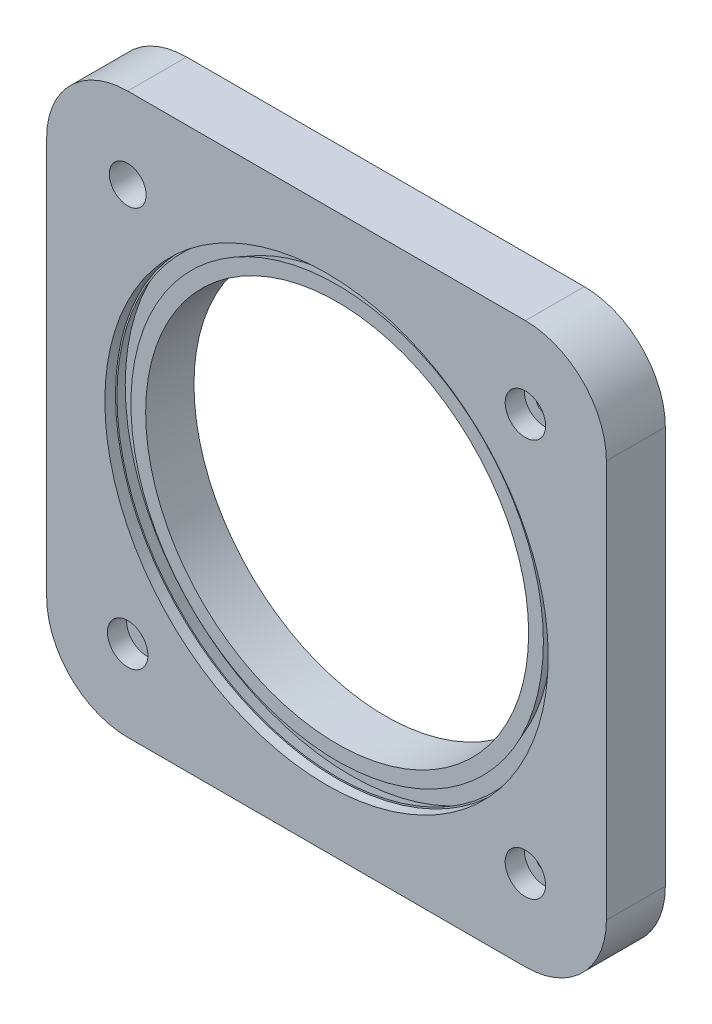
ISO-10303-21;
HEADER;
FILE_DESCRIPTION(('STEP AP214'),'2;1');
FILE_NAME('part.step','',(''),(''),'','','');
FILE_SCHEMA(('AUTOMOTIVE_DESIGN { 1 0 10303 214 1 1 1 1 }'));
ENDSEC;
DATA;
#1=APPLICATION_CONTEXT('core data for automotive mechanical design processes');
#2=APPLICATION_PROTOCOL_DEFINITION('international standard','automotive_design',2000,#1);
#3=PRODUCT_CONTEXT('',#1,'mechanical');
#4=PRODUCT('Part','Part','',(#3));
#5=PRODUCT_RELATED_PRODUCT_CATEGORY('part','',(#4));
#6=PRODUCT_DEFINITION_FORMATION('','',#4);
#7=PRODUCT_DEFINITION_CONTEXT('part definition',#1,'design');
#8=PRODUCT_DEFINITION('design','',#6,#7);
#9=PRODUCT_DEFINITION_SHAPE('','',#8);
#10=(LENGTH_UNIT() NAMED_UNIT(*) SI_UNIT(.MILLI.,.METRE.));
#11=(NAMED_UNIT(*) PLANE_ANGLE_UNIT() SI_UNIT($,.RADIAN.));
#12=(NAMED_UNIT(*) SI_UNIT($,.STERADIAN.) SOLID_ANGLE_UNIT());
#13=UNCERTAINTY_MEASURE_WITH_UNIT(LENGTH_MEASURE(1.E-05),#10,'distance_accuracy_value','');
#14=(GEOMETRIC_REPRESENTATION_CONTEXT(3) GLOBAL_UNCERTAINTY_ASSIGNED_CONTEXT((#13)) GLOBAL_UNIT_ASSIGNED_CONTEXT((#10,
#11,#12)) REPRESENTATION_CONTEXT('',''));
#15=CARTESIAN_POINT('',(0.,0.,0.));
#16=DIRECTION('',(0.,0.,1.));
#17=DIRECTION('',(1.,0.,0.));
#18=AXIS2_PLACEMENT_3D('',#15,#16,#17);
#19=CARTESIAN_POINT('',(-85.725,85.725,0.));
#20=DIRECTION('',(0.,0.,-1.));
#21=DIRECTION('',(-1.,0.,0.));
#22=AXIS2_PLACEMENT_3D('',#19,#20,#21);
#23=PLANE('',#22);
#24=CARTESIAN_POINT('',(0.,0.,0.));
#25=DIRECTION('',(0.,0.,1.));
#26=DIRECTION('',(1.,0.,0.));
#27=AXIS2_PLACEMENT_3D('',#24,#25,#26);
#28=CIRCLE('',#27,82.55);
#29=CARTESIAN_POINT('',(-82.55,0.,0.));
#30=VERTEX_POINT('',#29);
#31=EDGE_CURVE('E116',#30,#30,#28,.T.);
#32=ORIENTED_EDGE('',*,*,#31,.T.);
#33=EDGE_LOOP('',(#32));
#34=FACE_BOUND('',#33,.T.);
#35=CARTESIAN_POINT('',(0.,0.,0.));
#36=DIRECTION('',(0.,0.,-1.));
#37=DIRECTION('',(-1.,0.,0.));
#38=AXIS2_PLACEMENT_3D('',#35,#36,#37);
#39=CIRCLE('',#38,86.6267);
#40=CARTESIAN_POINT('',(-86.6267,0.,0.));
#41=VERTEX_POINT('',#40);
#42=EDGE_CURVE('E396',#41,#41,#39,.T.);
#43=ORIENTED_EDGE('',*,*,#42,.T.);
#44=EDGE_LOOP('',(#43));
#45=FACE_BOUND('',#44,.T.);
#46=ADVANCED_FACE('F31',(#34,#45),#23,.T.);
#47=CARTESIAN_POINT('',(-85.725,85.725,25.4));
#48=DIRECTION('',(0.,0.,-1.));
#49=DIRECTION('',(-1.,0.,0.));
#50=AXIS2_PLACEMENT_3D('',#47,#48,#49);
#51=PLANE('',#50);
#52=CARTESIAN_POINT('',(85.725,85.725,25.4));
#53=DIRECTION('',(0.,0.,-1.));
#54=DIRECTION('',(-1.,0.,0.));
#55=AXIS2_PLACEMENT_3D('',#52,#53,#54);
#56=CIRCLE('',#55,8.7122);
#57=CARTESIAN_POINT('',(77.0128,85.725,25.4));
#58=VERTEX_POINT('',#57);
#59=EDGE_CURVE('E193',#58,#58,#56,.T.);
#60=ORIENTED_EDGE('',*,*,#59,.T.);
#61=EDGE_LOOP('',(#60));
#62=FACE_BOUND('',#61,.T.);
#63=CARTESIAN_POINT('',(85.725,-85.725,25.4));
#64=DIRECTION('',(0.,0.,1.));
#65=DIRECTION('',(1.,0.,0.));
#66=AXIS2_PLACEMENT_3D('',#63,#64,#65);
#67=CIRCLE('',#66,8.7122);
#68=CARTESIAN_POINT('',(94.4372,-85.725,25.4));
#69=VERTEX_POINT('',#68);
#70=EDGE_CURVE('E186',#69,#69,#67,.T.);
#71=ORIENTED_EDGE('',*,*,#70,.F.);
#72=EDGE_LOOP('',(#71));
#73=FACE_BOUND('',#72,.T.);
#74=CARTESIAN_POINT('',(0.,0.,25.4));
#75=DIRECTION('',(0.,0.,1.));
#76=DIRECTION('',(1.,0.,0.));
#77=AXIS2_PLACEMENT_3D('',#74,#75,#76);
#78=CIRCLE('',#77,95.5675);
#79=CARTESIAN_POINT('',(95.5675,0.,25.4));
#80=VERTEX_POINT('',#79);
#81=EDGE_CURVE('E168',#80,#80,#78,.T.);
#82=ORIENTED_EDGE('',*,*,#81,.F.);
#83=EDGE_LOOP('',(#82));
#84=FACE_BOUND('',#83,.T.);
#85=CARTESIAN_POINT('',(-85.725,85.725,25.4));
#86=DIRECTION('',(0.,0.,-1.));
#87=DIRECTION('',(-1.,0.,0.));
#88=AXIS2_PLACEMENT_3D('',#85,#86,#87);
#89=CIRCLE('',#88,34.925);
#90=CARTESIAN_POINT('',(-120.65,85.7249999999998,25.4));
#91=VERTEX_POINT('',#90);
#92=CARTESIAN_POINT('',(-85.7249999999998,120.65,25.4));
#93=VERTEX_POINT('',#92);
#94=EDGE_CURVE('E99',#91,#93,#89,.T.);
#95=ORIENTED_EDGE('',*,*,#94,.F.);
#96=DIRECTION('',(0.,-1.,0.));
#97=VECTOR('',#96,1.);
#98=CARTESIAN_POINT('',(-120.65,85.7249999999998,25.4));
#99=LINE('',#98,#97);
#100=CARTESIAN_POINT('',(-120.65,-85.7249999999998,25.4));
#101=VERTEX_POINT('',#100);
#102=EDGE_CURVE('E105',#91,#101,#99,.T.);
#103=ORIENTED_EDGE('',*,*,#102,.T.);
#104=CARTESIAN_POINT('',(-85.725,-85.725,25.4));
#105=DIRECTION('',(0.,0.,-1.));
#106=DIRECTION('',(-1.,0.,0.));
#107=AXIS2_PLACEMENT_3D('',#104,#105,#106);
#108=CIRCLE('',#107,34.925);
#109=CARTESIAN_POINT('',(-85.7249999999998,-120.65,25.4));
#110=VERTEX_POINT('',#109);
#111=EDGE_CURVE('E151',#110,#101,#108,.T.);
#112=ORIENTED_EDGE('',*,*,#111,.F.);
#113=DIRECTION('',(-1.,0.,0.));
#114=VECTOR('',#113,1.);
#115=CARTESIAN_POINT('',(85.7249999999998,-120.65,25.4));
#116=LINE('',#115,#114);
#117=CARTESIAN_POINT('',(85.7249999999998,-120.65,25.4));
#118=VERTEX_POINT('',#117);
#119=EDGE_CURVE('E148',#118,#110,#116,.T.);
#120=ORIENTED_EDGE('',*,*,#119,.F.);
#121=CARTESIAN_POINT('',(85.725,-85.725,25.4));
#122=DIRECTION('',(0.,0.,1.));
#123=DIRECTION('',(1.,0.,0.));
#124=AXIS2_PLACEMENT_3D('',#121,#122,#123);
#125=CIRCLE('',#124,34.925);
#126=CARTESIAN_POINT('',(120.65,-85.7249999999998,25.4));
#127=VERTEX_POINT('',#126);
#128=EDGE_CURVE('E145',#118,#127,#125,.T.);
#129=ORIENTED_EDGE('',*,*,#128,.T.);
#130=DIRECTION('',(0.,-1.,0.));
#131=VECTOR('',#130,1.);
#132=CARTESIAN_POINT('',(120.65,85.7249999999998,25.4));
#133=LINE('',#132,#131);
#134=CARTESIAN_POINT('',(120.65,85.7249999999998,25.4));
#135=VERTEX_POINT('',#134);
#136=EDGE_CURVE('E142',#135,#127,#133,.T.);
#137=ORIENTED_EDGE('',*,*,#136,.F.);
#138=CARTESIAN_POINT('',(85.725,85.725,25.4));
#139=DIRECTION('',(0.,0.,-1.));
#140=DIRECTION('',(-1.,0.,0.));
#141=AXIS2_PLACEMENT_3D('',#138,#139,#140);
#142=CIRCLE('',#141,34.925);
#143=CARTESIAN_POINT('',(85.7249999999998,120.65,25.4));
#144=VERTEX_POINT('',#143);
#145=EDGE_CURVE('E139',#144,#135,#142,.T.);
#146=ORIENTED_EDGE('',*,*,#145,.F.);
#147=DIRECTION('',(-1.,0.,0.));
#148=VECTOR('',#147,1.);
#149=CARTESIAN_POINT('',(85.7249999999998,120.65,25.4));
#150=LINE('',#149,#148);
#151=EDGE_CURVE('E137',#144,#93,#150,.T.);
#152=ORIENTED_EDGE('',*,*,#151,.T.);
#153=EDGE_LOOP('',(#95,#103,#112,#120,#129,#137,#146,#152));
#154=FACE_BOUND('',#153,.T.);
#155=CARTESIAN_POINT('',(-85.725,85.725,25.4));
#156=DIRECTION('',(0.,0.,1.));
#157=DIRECTION('',(1.,0.,0.));
#158=AXIS2_PLACEMENT_3D('',#155,#156,#157);
#159=CIRCLE('',#158,7.9375);
#160=CARTESIAN_POINT('',(-93.6625,85.725,25.4));
#161=VERTEX_POINT('',#160);
#162=EDGE_CURVE('E238',#161,#161,#159,.T.);
#163=ORIENTED_EDGE('',*,*,#162,.F.);
#164=EDGE_LOOP('',(#163));
#165=FACE_BOUND('',#164,.T.);
#166=CARTESIAN_POINT('',(-85.725,-85.725,25.4));
#167=DIRECTION('',(0.,0.,-1.));
#168=DIRECTION('',(-1.,0.,0.));
#169=AXIS2_PLACEMENT_3D('',#166,#167,#168);
#170=CIRCLE('',#169,8.7122);
#171=CARTESIAN_POINT('',(-94.4372,-85.725,25.4));
#172=VERTEX_POINT('',#171);
#173=EDGE_CURVE('E383',#172,#172,#170,.T.);
#174=ORIENTED_EDGE('',*,*,#173,.T.);
#175=EDGE_LOOP('',(#174));
#176=FACE_BOUND('',#175,.T.);
#177=ADVANCED_FACE('F290',(#62,#73,#84,#154,#165,#176),#51,.F.);
#178=CARTESIAN_POINT('',(85.4964,-85.4964,25.4));
#179=DIRECTION('',(0.,0.,-1.));
#180=DIRECTION('',(-1.,0.,0.));
#181=AXIS2_PLACEMENT_3D('',#178,#179,#180);
#182=CYLINDRICAL_SURFACE('',#181,3.36549999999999);
#183=CARTESIAN_POINT('',(85.4964,-85.4964,2.54));
#184=DIRECTION('',(0.,0.,1.));
#185=DIRECTION('',(1.,0.,0.));
#186=AXIS2_PLACEMENT_3D('',#183,#184,#185);
#187=CIRCLE('',#186,3.36549999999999);
#188=CARTESIAN_POINT('',(82.1309,-85.4964,2.54));
#189=VERTEX_POINT('',#188);
#190=EDGE_CURVE('E170',#189,#189,#187,.F.);
#191=CARTESIAN_POINT('',(85.4964,-85.4964,17.145));
#192=DIRECTION('',(0.,0.,1.));
#193=DIRECTION('',(1.,0.,0.));
#194=AXIS2_PLACEMENT_3D('',#191,#192,#193);
#195=CIRCLE('',#194,3.36549999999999);
#196=CARTESIAN_POINT('',(82.1309,-85.4964,17.145));
#197=VERTEX_POINT('',#196);
#198=EDGE_CURVE('E180',#197,#197,#195,.F.);
#199=CARTESIAN_POINT('',(82.1309,-85.4964,2.54));
#200=CARTESIAN_POINT('',(82.1309,-85.4964,2.69213541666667));
#201=CARTESIAN_POINT('',(82.1309,-85.4964,2.84427083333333));
#202=CARTESIAN_POINT('',(82.1309,-85.4964,3.14854166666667));
#203=CARTESIAN_POINT('',(82.1309,-85.4964,3.30067708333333));
#204=CARTESIAN_POINT('',(82.1309,-85.4964,3.60494791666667));
#205=CARTESIAN_POINT('',(82.1309,-85.4964,3.75708333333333));
#206=CARTESIAN_POINT('',(82.1309,-85.4964,4.06135416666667));
#207=CARTESIAN_POINT('',(82.1309,-85.4964,4.21348958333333));
#208=CARTESIAN_POINT('',(82.1309,-85.4964,4.51776041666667));
#209=CARTESIAN_POINT('',(82.1309,-85.4964,4.66989583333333));
#210=CARTESIAN_POINT('',(82.1309,-85.4964,4.97416666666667));
#211=CARTESIAN_POINT('',(82.1309,-85.4964,5.12630208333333));
#212=CARTESIAN_POINT('',(82.1309,-85.4964,5.43057291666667));
#213=CARTESIAN_POINT('',(82.1309,-85.4964,5.58270833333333));
#214=CARTESIAN_POINT('',(82.1309,-85.4964,5.88697916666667));
#215=CARTESIAN_POINT('',(82.1309,-85.4964,6.03911458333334));
#216=CARTESIAN_POINT('',(82.1309,-85.4964,6.34338541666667));
#217=CARTESIAN_POINT('',(82.1309,-85.4964,6.49552083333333));
#218=CARTESIAN_POINT('',(82.1309,-85.4964,6.79979166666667));
#219=CARTESIAN_POINT('',(82.1309,-85.4964,6.95192708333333));
#220=CARTESIAN_POINT('',(82.1309,-85.4964,7.25619791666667));
#221=CARTESIAN_POINT('',(82.1309,-85.4964,7.40833333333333));
#222=CARTESIAN_POINT('',(82.1309,-85.4964,7.71260416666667));
#223=CARTESIAN_POINT('',(82.1309,-85.4964,7.86473958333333));
#224=CARTESIAN_POINT('',(82.1309,-85.4964,8.16901041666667));
#225=CARTESIAN_POINT('',(82.1309,-85.4964,8.32114583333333));
#226=CARTESIAN_POINT('',(82.1309,-85.4964,8.62541666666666));
#227=CARTESIAN_POINT('',(82.1309,-85.4964,8.77755208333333));
#228=CARTESIAN_POINT('',(82.1309,-85.4964,9.08182291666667));
#229=CARTESIAN_POINT('',(82.1309,-85.4964,9.23395833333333));
#230=CARTESIAN_POINT('',(82.1309,-85.4964,9.53822916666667));
#231=CARTESIAN_POINT('',(82.1309,-85.4964,9.69036458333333));
#232=CARTESIAN_POINT('',(82.1309,-85.4964,9.99463541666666));
#233=CARTESIAN_POINT('',(82.1309,-85.4964,10.1467708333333));
#234=CARTESIAN_POINT('',(82.1309,-85.4964,10.4510416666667));
#235=CARTESIAN_POINT('',(82.1309,-85.4964,10.6031770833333));
#236=CARTESIAN_POINT('',(82.1309,-85.4964,10.9074479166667));
#237=CARTESIAN_POINT('',(82.1309,-85.4964,11.0595833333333));
#238=CARTESIAN_POINT('',(82.1309,-85.4964,11.3638541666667));
#239=CARTESIAN_POINT('',(82.1309,-85.4964,11.5159895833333));
#240=CARTESIAN_POINT('',(82.1309,-85.4964,11.8202604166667));
#241=CARTESIAN_POINT('',(82.1309,-85.4964,11.9723958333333));
#242=CARTESIAN_POINT('',(82.1309,-85.4964,12.2766666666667));
#243=CARTESIAN_POINT('',(82.1309,-85.4964,12.4288020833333));
#244=CARTESIAN_POINT('',(82.1309,-85.4964,12.7330729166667));
#245=CARTESIAN_POINT('',(82.1309,-85.4964,12.8852083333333));
#246=CARTESIAN_POINT('',(82.1309,-85.4964,13.1894791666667));
#247=CARTESIAN_POINT('',(82.1309,-85.4964,13.3416145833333));
#248=CARTESIAN_POINT('',(82.1309,-85.4964,13.6458854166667));
#249=CARTESIAN_POINT('',(82.1309,-85.4964,13.7980208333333));
#250=CARTESIAN_POINT('',(82.1309,-85.4964,14.1022916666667));
#251=CARTESIAN_POINT('',(82.1309,-85.4964,14.2544270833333));
#252=CARTESIAN_POINT('',(82.1309,-85.4964,14.5586979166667));
#253=CARTESIAN_POINT('',(82.1309,-85.4964,14.7108333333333));
#254=CARTESIAN_POINT('',(82.1309,-85.4964,15.0151041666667));
#255=CARTESIAN_POINT('',(82.1309,-85.4964,15.1672395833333));
#256=CARTESIAN_POINT('',(82.1309,-85.4964,15.4715104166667));
#257=CARTESIAN_POINT('',(82.1309,-85.4964,15.6236458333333));
#258=CARTESIAN_POINT('',(82.1309,-85.4964,15.9279166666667));
#259=CARTESIAN_POINT('',(82.1309,-85.4964,16.0800520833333));
#260=CARTESIAN_POINT('',(82.1309,-85.4964,16.3843229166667));
#261=CARTESIAN_POINT('',(82.1309,-85.4964,16.5364583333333));
#262=CARTESIAN_POINT('',(82.1309,-85.4964,16.8407291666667));
#263=CARTESIAN_POINT('',(82.1309,-85.4964,16.9928645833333));
#264=CARTESIAN_POINT('',(82.1309,-85.4964,17.145));
#265=B_SPLINE_CURVE_WITH_KNOTS('',3,(#199,#200,#201,#202,#203,#204,#205,#206,#207,#208,#209,
#210,#211,#212,#213,#214,#215,#216,#217,#218,#219,#220,#221,#222,#223,#224,#225,#226,#227,#228,
#229,#230,#231,#232,#233,#234,#235,#236,#237,#238,#239,#240,#241,#242,#243,#244,#245,#246,#247,
#248,#249,#250,#251,#252,#253,#254,#255,#256,#257,#258,#259,#260,#261,#262,#263,#264),
.UNSPECIFIED.,.F.,.F.,(4,2,2,2,2,2,2,2,2,2,2,2,2,2,2,2,2,2,2,2,2,2,2,2,2,2,2,2,2,2,2,2,4),(0.,
0.456406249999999,0.912812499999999,1.36921875,1.825625,2.28203125,2.7384375,3.19484375,3.65125,
4.10765625,4.5640625,5.02046875,5.476875,5.93328125,6.3896875,6.84609375,7.3025,7.75890625,
8.2153125,8.67171875,9.128125,9.58453125,10.0409375,10.49734375,10.95375,11.41015625,11.8665625,
12.32296875,12.779375,13.23578125,13.6921875,14.14859375,14.605),.UNSPECIFIED.);
#266=EDGE_CURVE('BSEAM295',#189,#197,#265,.T.);
#267=ORIENTED_EDGE('',*,*,#190,.T.);
#268=ORIENTED_EDGE('',*,*,#198,.F.);
#269=ORIENTED_EDGE('',*,*,#266,.T.);
#270=ORIENTED_EDGE('',*,*,#266,.F.);
#271=EDGE_LOOP('',(#267,#269,#268,#270));
#272=FACE_BOUND('',#271,.T.);
#273=ADVANCED_FACE('F295',(#272),#182,.F.);
#274=CARTESIAN_POINT('',(85.4964,85.4964,25.4));
#275=DIRECTION('',(0.,0.,-1.));
#276=DIRECTION('',(-1.,0.,0.));
#277=AXIS2_PLACEMENT_3D('',#274,#275,#276);
#278=CYLINDRICAL_SURFACE('',#277,3.36549999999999);
#279=CARTESIAN_POINT('',(85.4964,85.4964,17.145));
#280=DIRECTION('',(0.,0.,-1.));
#281=DIRECTION('',(-1.,0.,0.));
#282=AXIS2_PLACEMENT_3D('',#279,#280,#281);
#283=CIRCLE('',#282,3.36549999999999);
#284=CARTESIAN_POINT('',(82.1309,85.4964,17.145));
#285=VERTEX_POINT('',#284);
#286=EDGE_CURVE('E184',#285,#285,#283,.T.);
#287=CARTESIAN_POINT('',(85.4964,85.4964,2.54));
#288=DIRECTION('',(0.,0.,-1.));
#289=DIRECTION('',(-1.,0.,0.));
#290=AXIS2_PLACEMENT_3D('',#287,#288,#289);
#291=CIRCLE('',#290,3.36549999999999);
#292=CARTESIAN_POINT('',(82.1309,85.4964,2.54));
#293=VERTEX_POINT('',#292);
#294=EDGE_CURVE('E175',#293,#293,#291,.T.);
#295=CARTESIAN_POINT('',(82.1309,85.4964,17.145));
#296=CARTESIAN_POINT('',(82.1309,85.4964,16.9928645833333));
#297=CARTESIAN_POINT('',(82.1309,85.4964,16.8407291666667));
#298=CARTESIAN_POINT('',(82.1309,85.4964,16.5364583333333));
#299=CARTESIAN_POINT('',(82.1309,85.4964,16.3843229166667));
#300=CARTESIAN_POINT('',(82.1309,85.4964,16.0800520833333));
#301=CARTESIAN_POINT('',(82.1309,85.4964,15.9279166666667));
#302=CARTESIAN_POINT('',(82.1309,85.4964,15.6236458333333));
#303=CARTESIAN_POINT('',(82.1309,85.4964,15.4715104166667));
#304=CARTESIAN_POINT('',(82.1309,85.4964,15.1672395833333));
#305=CARTESIAN_POINT('',(82.1309,85.4964,15.0151041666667));
#306=CARTESIAN_POINT('',(82.1309,85.4964,14.7108333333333));
#307=CARTESIAN_POINT('',(82.1309,85.4964,14.5586979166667));
#308=CARTESIAN_POINT('',(82.1309,85.4964,14.2544270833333));
#309=CARTESIAN_POINT('',(82.1309,85.4964,14.1022916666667));
#310=CARTESIAN_POINT('',(82.1309,85.4964,13.7980208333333));
#311=CARTESIAN_POINT('',(82.1309,85.4964,13.6458854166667));
#312=CARTESIAN_POINT('',(82.1309,85.4964,13.3416145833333));
#313=CARTESIAN_POINT('',(82.1309,85.4964,13.1894791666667));
#314=CARTESIAN_POINT('',(82.1309,85.4964,12.8852083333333));
#315=CARTESIAN_POINT('',(82.1309,85.4964,12.7330729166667));
#316=CARTESIAN_POINT('',(82.1309,85.4964,12.4288020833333));
#317=CARTESIAN_POINT('',(82.1309,85.4964,12.2766666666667));
#318=CARTESIAN_POINT('',(82.1309,85.4964,11.9723958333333));
#319=CARTESIAN_POINT('',(82.1309,85.4964,11.8202604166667));
#320=CARTESIAN_POINT('',(82.1309,85.4964,11.5159895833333));
#321=CARTESIAN_POINT('',(82.1309,85.4964,11.3638541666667));
#322=CARTESIAN_POINT('',(82.1309,85.4964,11.0595833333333));
#323=CARTESIAN_POINT('',(82.1309,85.4964,10.9074479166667));
#324=CARTESIAN_POINT('',(82.1309,85.4964,10.6031770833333));
#325=CARTESIAN_POINT('',(82.1309,85.4964,10.4510416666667));
#326=CARTESIAN_POINT('',(82.1309,85.4964,10.1467708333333));
#327=CARTESIAN_POINT('',(82.1309,85.4964,9.99463541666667));
#328=CARTESIAN_POINT('',(82.1309,85.4964,9.69036458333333));
#329=CARTESIAN_POINT('',(82.1309,85.4964,9.53822916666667));
#330=CARTESIAN_POINT('',(82.1309,85.4964,9.23395833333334));
#331=CARTESIAN_POINT('',(82.1309,85.4964,9.08182291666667));
#332=CARTESIAN_POINT('',(82.1309,85.4964,8.77755208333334));
#333=CARTESIAN_POINT('',(82.1309,85.4964,8.62541666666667));
#334=CARTESIAN_POINT('',(82.1309,85.4964,8.32114583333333));
#335=CARTESIAN_POINT('',(82.1309,85.4964,8.16901041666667));
#336=CARTESIAN_POINT('',(82.1309,85.4964,7.86473958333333));
#337=CARTESIAN_POINT('',(82.1309,85.4964,7.71260416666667));
#338=CARTESIAN_POINT('',(82.1309,85.4964,7.40833333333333));
#339=CARTESIAN_POINT('',(82.1309,85.4964,7.25619791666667));
#340=CARTESIAN_POINT('',(82.1309,85.4964,6.95192708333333));
#341=CARTESIAN_POINT('',(82.1309,85.4964,6.79979166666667));
#342=CARTESIAN_POINT('',(82.1309,85.4964,6.49552083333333));
#343=CARTESIAN_POINT('',(82.1309,85.4964,6.34338541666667));
#344=CARTESIAN_POINT('',(82.1309,85.4964,6.03911458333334));
#345=CARTESIAN_POINT('',(82.1309,85.4964,5.88697916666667));
#346=CARTESIAN_POINT('',(82.1309,85.4964,5.58270833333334));
#347=CARTESIAN_POINT('',(82.1309,85.4964,5.43057291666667));
#348=CARTESIAN_POINT('',(82.1309,85.4964,5.12630208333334));
#349=CARTESIAN_POINT('',(82.1309,85.4964,4.97416666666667));
#350=CARTESIAN_POINT('',(82.1309,85.4964,4.66989583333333));
#351=CARTESIAN_POINT('',(82.1309,85.4964,4.51776041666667));
#352=CARTESIAN_POINT('',(82.1309,85.4964,4.21348958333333));
#353=CARTESIAN_POINT('',(82.1309,85.4964,4.06135416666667));
#354=CARTESIAN_POINT('',(82.1309,85.4964,3.75708333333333));
#355=CARTESIAN_POINT('',(82.1309,85.4964,3.60494791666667));
#356=CARTESIAN_POINT('',(82.1309,85.4964,3.30067708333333));
#357=CARTESIAN_POINT('',(82.1309,85.4964,3.14854166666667));
#358=CARTESIAN_POINT('',(82.1309,85.4964,2.84427083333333));
#359=CARTESIAN_POINT('',(82.1309,85.4964,2.69213541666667));
#360=CARTESIAN_POINT('',(82.1309,85.4964,2.54));
#361=B_SPLINE_CURVE_WITH_KNOTS('',3,(#295,#296,#297,#298,#299,#300,#301,#302,#303,#304,#305,
#306,#307,#308,#309,#310,#311,#312,#313,#314,#315,#316,#317,#318,#319,#320,#321,#322,#323,#324,
#325,#326,#327,#328,#329,#330,#331,#332,#333,#334,#335,#336,#337,#338,#339,#340,#341,#342,#343,
#344,#345,#346,#347,#348,#349,#350,#351,#352,#353,#354,#355,#356,#357,#358,#359,#360),
.UNSPECIFIED.,.F.,.F.,(4,2,2,2,2,2,2,2,2,2,2,2,2,2,2,2,2,2,2,2,2,2,2,2,2,2,2,2,2,2,2,2,4),(0.,
0.456406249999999,0.912812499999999,1.36921875,1.825625,2.28203125,2.7384375,3.19484375,3.65125,
4.10765625,4.5640625,5.02046875,5.476875,5.93328125,6.3896875,6.84609375,7.3025,7.75890625,
8.2153125,8.67171875,9.128125,9.58453125,10.0409375,10.49734375,10.95375,11.41015625,11.8665625,
12.32296875,12.779375,13.23578125,13.6921875,14.14859375,14.605),.UNSPECIFIED.);
#362=EDGE_CURVE('BSEAM299',#285,#293,#361,.T.);
#363=ORIENTED_EDGE('',*,*,#286,.F.);
#364=ORIENTED_EDGE('',*,*,#294,.T.);
#365=ORIENTED_EDGE('',*,*,#362,.T.);
#366=ORIENTED_EDGE('',*,*,#362,.F.);
#367=EDGE_LOOP('',(#363,#365,#364,#366));
#368=FACE_BOUND('',#367,.T.);
#369=ADVANCED_FACE('F299',(#368),#278,.F.);
#370=CARTESIAN_POINT('',(0.,0.,0.));
#371=DIRECTION('',(0.,0.,-1.));
#372=DIRECTION('',(-1.,0.,0.));
#373=AXIS2_PLACEMENT_3D('',#370,#371,#372);
#374=CIRCLE('',#373,95.5675);
#375=CARTESIAN_POINT('',(-95.5675,0.,0.));
#376=VERTEX_POINT('',#375);
#377=EDGE_CURVE('E312',#376,#376,#374,.T.);
#378=ORIENTED_EDGE('',*,*,#377,.F.);
#379=EDGE_LOOP('',(#378));
#380=FACE_BOUND('',#379,.T.);
#381=CARTESIAN_POINT('',(85.725,85.725,0.));
#382=DIRECTION('',(0.,0.,-1.));
#383=DIRECTION('',(-1.,0.,0.));
#384=AXIS2_PLACEMENT_3D('',#381,#382,#383);
#385=CIRCLE('',#384,6.477);
#386=CARTESIAN_POINT('',(79.248,85.725,0.));
#387=VERTEX_POINT('',#386);
#388=EDGE_CURVE('E182',#387,#387,#385,.T.);
#389=ORIENTED_EDGE('',*,*,#388,.F.);
#390=EDGE_LOOP('',(#389));
#391=FACE_BOUND('',#390,.T.);
#392=CARTESIAN_POINT('',(-85.725,85.725,0.));
#393=DIRECTION('',(0.,0.,1.));
#394=DIRECTION('',(1.,0.,0.));
#395=AXIS2_PLACEMENT_3D('',#392,#393,#394);
#396=CIRCLE('',#395,7.9375);
#397=CARTESIAN_POINT('',(-93.6625,85.725,0.));
#398=VERTEX_POINT('',#397);
#399=EDGE_CURVE('E235',#398,#398,#396,.T.);
#400=ORIENTED_EDGE('',*,*,#399,.T.);
#401=EDGE_LOOP('',(#400));
#402=FACE_BOUND('',#401,.T.);
#403=CARTESIAN_POINT('',(-85.725,85.725,0.));
#404=DIRECTION('',(0.,0.,-1.));
#405=DIRECTION('',(-1.,0.,0.));
#406=AXIS2_PLACEMENT_3D('',#403,#404,#405);
#407=CIRCLE('',#406,34.925);
#408=CARTESIAN_POINT('',(-120.65,85.7249999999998,0.));
#409=VERTEX_POINT('',#408);
#410=CARTESIAN_POINT('',(-85.7249999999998,120.65,0.));
#411=VERTEX_POINT('',#410);
#412=EDGE_CURVE('E97',#409,#411,#407,.T.);
#413=ORIENTED_EDGE('',*,*,#412,.T.);
#414=DIRECTION('',(-1.,0.,0.));
#415=VECTOR('',#414,1.);
#416=CARTESIAN_POINT('',(85.7249999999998,120.65,0.));
#417=LINE('',#416,#415);
#418=CARTESIAN_POINT('',(85.7249999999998,120.65,0.));
#419=VERTEX_POINT('',#418);
#420=EDGE_CURVE('E112',#419,#411,#417,.T.);
#421=ORIENTED_EDGE('',*,*,#420,.F.);
#422=CARTESIAN_POINT('',(85.725,85.725,0.));
#423=DIRECTION('',(0.,0.,-1.));
#424=DIRECTION('',(-1.,0.,0.));
#425=AXIS2_PLACEMENT_3D('',#422,#423,#424);
#426=CIRCLE('',#425,34.925);
#427=CARTESIAN_POINT('',(120.65,85.7249999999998,0.));
#428=VERTEX_POINT('',#427);
#429=EDGE_CURVE('E119',#419,#428,#426,.T.);
#430=ORIENTED_EDGE('',*,*,#429,.T.);
#431=DIRECTION('',(0.,-1.,0.));
#432=VECTOR('',#431,1.);
#433=CARTESIAN_POINT('',(120.65,85.7249999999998,0.));
#434=LINE('',#433,#432);
#435=CARTESIAN_POINT('',(120.65,-85.7249999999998,0.));
#436=VERTEX_POINT('',#435);
#437=EDGE_CURVE('E121',#428,#436,#434,.T.);
#438=ORIENTED_EDGE('',*,*,#437,.T.);
#439=CARTESIAN_POINT('',(85.725,-85.725,0.));
#440=DIRECTION('',(0.,0.,1.));
#441=DIRECTION('',(1.,0.,0.));
#442=AXIS2_PLACEMENT_3D('',#439,#440,#441);
#443=CIRCLE('',#442,34.925);
#444=CARTESIAN_POINT('',(85.7249999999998,-120.65,0.));
#445=VERTEX_POINT('',#444);
#446=EDGE_CURVE('E127',#445,#436,#443,.T.);
#447=ORIENTED_EDGE('',*,*,#446,.F.);
#448=DIRECTION('',(-1.,0.,0.));
#449=VECTOR('',#448,1.);
#450=CARTESIAN_POINT('',(85.7249999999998,-120.65,0.));
#451=LINE('',#450,#449);
#452=CARTESIAN_POINT('',(-85.7249999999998,-120.65,0.));
#453=VERTEX_POINT('',#452);
#454=EDGE_CURVE('E130',#445,#453,#451,.T.);
#455=ORIENTED_EDGE('',*,*,#454,.T.);
#456=CARTESIAN_POINT('',(-85.725,-85.725,0.));
#457=DIRECTION('',(0.,0.,-1.));
#458=DIRECTION('',(-1.,0.,0.));
#459=AXIS2_PLACEMENT_3D('',#456,#457,#458);
#460=CIRCLE('',#459,34.925);
#461=CARTESIAN_POINT('',(-120.65,-85.7249999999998,0.));
#462=VERTEX_POINT('',#461);
#463=EDGE_CURVE('E133',#453,#462,#460,.T.);
#464=ORIENTED_EDGE('',*,*,#463,.T.);
#465=DIRECTION('',(0.,-1.,0.));
#466=VECTOR('',#465,1.);
#467=CARTESIAN_POINT('',(-120.65,85.7249999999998,0.));
#468=LINE('',#467,#466);
#469=EDGE_CURVE('E115',#409,#462,#468,.T.);
#470=ORIENTED_EDGE('',*,*,#469,.F.);
#471=EDGE_LOOP('',(#413,#421,#430,#438,#447,#455,#464,#470));
#472=FACE_BOUND('',#471,.T.);
#473=CARTESIAN_POINT('',(-85.725,-85.725,0.));
#474=DIRECTION('',(0.,0.,-1.));
#475=DIRECTION('',(-1.,0.,0.));
#476=AXIS2_PLACEMENT_3D('',#473,#474,#475);
#477=CIRCLE('',#476,6.477);
#478=CARTESIAN_POINT('',(-92.202,-85.725,0.));
#479=VERTEX_POINT('',#478);
#480=EDGE_CURVE('E173',#479,#479,#477,.T.);
#481=ORIENTED_EDGE('',*,*,#480,.F.);
#482=EDGE_LOOP('',(#481));
#483=FACE_BOUND('',#482,.T.);
#484=CARTESIAN_POINT('',(85.725,-85.725,0.));
#485=DIRECTION('',(0.,0.,1.));
#486=DIRECTION('',(1.,0.,0.));
#487=AXIS2_PLACEMENT_3D('',#484,#485,#486);
#488=CIRCLE('',#487,6.477);
#489=CARTESIAN_POINT('',(92.202,-85.725,0.));
#490=VERTEX_POINT('',#489);
#491=EDGE_CURVE('E178',#490,#490,#488,.T.);
#492=ORIENTED_EDGE('',*,*,#491,.T.);
#493=EDGE_LOOP('',(#492));
#494=FACE_BOUND('',#493,.T.);
#495=ADVANCED_FACE('F109',(#380,#391,#402,#472,#483,#494),#23,.T.);
#496=CARTESIAN_POINT('',(-85.4964,-85.4964,25.4));
#497=DIRECTION('',(0.,0.,-1.));
#498=DIRECTION('',(-1.,0.,0.));
#499=AXIS2_PLACEMENT_3D('',#496,#497,#498);
#500=CYLINDRICAL_SURFACE('',#499,3.36549999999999);
#501=CARTESIAN_POINT('',(-85.4964,-85.4964,17.145));
#502=DIRECTION('',(0.,0.,-1.));
#503=DIRECTION('',(-1.,0.,0.));
#504=AXIS2_PLACEMENT_3D('',#501,#502,#503);
#505=CIRCLE('',#504,3.36549999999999);
#506=CARTESIAN_POINT('',(-88.8619,-85.4964,17.145));
#507=VERTEX_POINT('',#506);
#508=EDGE_CURVE('E35',#507,#507,#505,.T.);
#509=CARTESIAN_POINT('',(-85.4964,-85.4964,2.54));
#510=DIRECTION('',(0.,0.,-1.));
#511=DIRECTION('',(-1.,0.,0.));
#512=AXIS2_PLACEMENT_3D('',#509,#510,#511);
#513=CIRCLE('',#512,3.36549999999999);
#514=CARTESIAN_POINT('',(-88.8619,-85.4964,2.54));
#515=VERTEX_POINT('',#514);
#516=EDGE_CURVE('E165',#515,#515,#513,.T.);
#517=CARTESIAN_POINT('',(-88.8619,-85.4964,17.145));
#518=CARTESIAN_POINT('',(-88.8619,-85.4964,16.9928645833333));
#519=CARTESIAN_POINT('',(-88.8619,-85.4964,16.8407291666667));
#520=CARTESIAN_POINT('',(-88.8619,-85.4964,16.5364583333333));
#521=CARTESIAN_POINT('',(-88.8619,-85.4964,16.3843229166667));
#522=CARTESIAN_POINT('',(-88.8619,-85.4964,16.0800520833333));
#523=CARTESIAN_POINT('',(-88.8619,-85.4964,15.9279166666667));
#524=CARTESIAN_POINT('',(-88.8619,-85.4964,15.6236458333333));
#525=CARTESIAN_POINT('',(-88.8619,-85.4964,15.4715104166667));
#526=CARTESIAN_POINT('',(-88.8619,-85.4964,15.1672395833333));
#527=CARTESIAN_POINT('',(-88.8619,-85.4964,15.0151041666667));
#528=CARTESIAN_POINT('',(-88.8619,-85.4964,14.7108333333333));
#529=CARTESIAN_POINT('',(-88.8619,-85.4964,14.5586979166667));
#530=CARTESIAN_POINT('',(-88.8619,-85.4964,14.2544270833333));
#531=CARTESIAN_POINT('',(-88.8619,-85.4964,14.1022916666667));
#532=CARTESIAN_POINT('',(-88.8619,-85.4964,13.7980208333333));
#533=CARTESIAN_POINT('',(-88.8619,-85.4964,13.6458854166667));
#534=CARTESIAN_POINT('',(-88.8619,-85.4964,13.3416145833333));
#535=CARTESIAN_POINT('',(-88.8619,-85.4964,13.1894791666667));
#536=CARTESIAN_POINT('',(-88.8619,-85.4964,12.8852083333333));
#537=CARTESIAN_POINT('',(-88.8619,-85.4964,12.7330729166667));
#538=CARTESIAN_POINT('',(-88.8619,-85.4964,12.4288020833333));
#539=CARTESIAN_POINT('',(-88.8619,-85.4964,12.2766666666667));
#540=CARTESIAN_POINT('',(-88.8619,-85.4964,11.9723958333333));
#541=CARTESIAN_POINT('',(-88.8619,-85.4964,11.8202604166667));
#542=CARTESIAN_POINT('',(-88.8619,-85.4964,11.5159895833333));
#543=CARTESIAN_POINT('',(-88.8619,-85.4964,11.3638541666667));
#544=CARTESIAN_POINT('',(-88.8619,-85.4964,11.0595833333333));
#545=CARTESIAN_POINT('',(-88.8619,-85.4964,10.9074479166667));
#546=CARTESIAN_POINT('',(-88.8619,-85.4964,10.6031770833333));
#547=CARTESIAN_POINT('',(-88.8619,-85.4964,10.4510416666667));
#548=CARTESIAN_POINT('',(-88.8619,-85.4964,10.1467708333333));
#549=CARTESIAN_POINT('',(-88.8619,-85.4964,9.99463541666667));
#550=CARTESIAN_POINT('',(-88.8619,-85.4964,9.69036458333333));
#551=CARTESIAN_POINT('',(-88.8619,-85.4964,9.53822916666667));
#552=CARTESIAN_POINT('',(-88.8619,-85.4964,9.23395833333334));
#553=CARTESIAN_POINT('',(-88.8619,-85.4964,9.08182291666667));
#554=CARTESIAN_POINT('',(-88.8619,-85.4964,8.77755208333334));
#555=CARTESIAN_POINT('',(-88.8619,-85.4964,8.62541666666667));
#556=CARTESIAN_POINT('',(-88.8619,-85.4964,8.32114583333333));
#557=CARTESIAN_POINT('',(-88.8619,-85.4964,8.16901041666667));
#558=CARTESIAN_POINT('',(-88.8619,-85.4964,7.86473958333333));
#559=CARTESIAN_POINT('',(-88.8619,-85.4964,7.71260416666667));
#560=CARTESIAN_POINT('',(-88.8619,-85.4964,7.40833333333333));
#561=CARTESIAN_POINT('',(-88.8619,-85.4964,7.25619791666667));
#562=CARTESIAN_POINT('',(-88.8619,-85.4964,6.95192708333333));
#563=CARTESIAN_POINT('',(-88.8619,-85.4964,6.79979166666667));
#564=CARTESIAN_POINT('',(-88.8619,-85.4964,6.49552083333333));
#565=CARTESIAN_POINT('',(-88.8619,-85.4964,6.34338541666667));
#566=CARTESIAN_POINT('',(-88.8619,-85.4964,6.03911458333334));
#567=CARTESIAN_POINT('',(-88.8619,-85.4964,5.88697916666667));
#568=CARTESIAN_POINT('',(-88.8619,-85.4964,5.58270833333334));
#569=CARTESIAN_POINT('',(-88.8619,-85.4964,5.43057291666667));
#570=CARTESIAN_POINT('',(-88.8619,-85.4964,5.12630208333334));
#571=CARTESIAN_POINT('',(-88.8619,-85.4964,4.97416666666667));
#572=CARTESIAN_POINT('',(-88.8619,-85.4964,4.66989583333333));
#573=CARTESIAN_POINT('',(-88.8619,-85.4964,4.51776041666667));
#574=CARTESIAN_POINT('',(-88.8619,-85.4964,4.21348958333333));
#575=CARTESIAN_POINT('',(-88.8619,-85.4964,4.06135416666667));
#576=CARTESIAN_POINT('',(-88.8619,-85.4964,3.75708333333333));
#577=CARTESIAN_POINT('',(-88.8619,-85.4964,3.60494791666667));
#578=CARTESIAN_POINT('',(-88.8619,-85.4964,3.30067708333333));
#579=CARTESIAN_POINT('',(-88.8619,-85.4964,3.14854166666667));
#580=CARTESIAN_POINT('',(-88.8619,-85.4964,2.84427083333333));
#581=CARTESIAN_POINT('',(-88.8619,-85.4964,2.69213541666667));
#582=CARTESIAN_POINT('',(-88.8619,-85.4964,2.54));
#583=B_SPLINE_CURVE_WITH_KNOTS('',3,(#517,#518,#519,#520,#521,#522,#523,#524,#525,#526,#527,
#528,#529,#530,#531,#532,#533,#534,#535,#536,#537,#538,#539,#540,#541,#542,#543,#544,#545,#546,
#547,#548,#549,#550,#551,#552,#553,#554,#555,#556,#557,#558,#559,#560,#561,#562,#563,#564,#565,
#566,#567,#568,#569,#570,#571,#572,#573,#574,#575,#576,#577,#578,#579,#580,#581,#582),
.UNSPECIFIED.,.F.,.F.,(4,2,2,2,2,2,2,2,2,2,2,2,2,2,2,2,2,2,2,2,2,2,2,2,2,2,2,2,2,2,2,2,4),(0.,
0.456406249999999,0.912812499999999,1.36921875,1.825625,2.28203125,2.7384375,3.19484375,3.65125,
4.10765625,4.5640625,5.02046875,5.476875,5.93328125,6.3896875,6.84609375,7.3025,7.75890625,
8.2153125,8.67171875,9.128125,9.58453125,10.0409375,10.49734375,10.95375,11.41015625,11.8665625,
12.32296875,12.779375,13.23578125,13.6921875,14.14859375,14.605),.UNSPECIFIED.);
#584=EDGE_CURVE('BSEAM248',#507,#515,#583,.T.);
#585=ORIENTED_EDGE('',*,*,#508,.F.);
#586=ORIENTED_EDGE('',*,*,#516,.T.);
#587=ORIENTED_EDGE('',*,*,#584,.T.);
#588=ORIENTED_EDGE('',*,*,#584,.F.);
#589=EDGE_LOOP('',(#585,#587,#586,#588));
#590=FACE_BOUND('',#589,.T.);
#591=ADVANCED_FACE('F248',(#590),#500,.F.);
#592=CARTESIAN_POINT('',(0.,0.,25.4));
#593=DIRECTION('',(0.,0.,-1.));
#594=DIRECTION('',(-1.,0.,0.));
#595=AXIS2_PLACEMENT_3D('',#592,#593,#594);
#596=CYLINDRICAL_SURFACE('',#595,82.55);
#597=CARTESIAN_POINT('',(0.,0.,20.828));
#598=DIRECTION('',(0.,0.,1.));
#599=DIRECTION('',(1.,0.,0.));
#600=AXIS2_PLACEMENT_3D('',#597,#598,#599);
#601=CIRCLE('',#600,82.55);
#602=CARTESIAN_POINT('',(-82.55,0.,20.828));
#603=VERTEX_POINT('',#602);
#604=EDGE_CURVE('E226',#603,#603,#601,.T.);
#605=CARTESIAN_POINT('',(-82.55,0.,0.));
#606=CARTESIAN_POINT('',(-82.55,0.,0.216958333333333));
#607=CARTESIAN_POINT('',(-82.55,0.,0.433916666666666));
#608=CARTESIAN_POINT('',(-82.55,0.,0.867833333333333));
#609=CARTESIAN_POINT('',(-82.55,0.,1.08479166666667));
#610=CARTESIAN_POINT('',(-82.55,0.,1.51870833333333));
#611=CARTESIAN_POINT('',(-82.55,0.,1.73566666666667));
#612=CARTESIAN_POINT('',(-82.55,0.,2.16958333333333));
#613=CARTESIAN_POINT('',(-82.55,0.,2.38654166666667));
#614=CARTESIAN_POINT('',(-82.55,0.,2.82045833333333));
#615=CARTESIAN_POINT('',(-82.55,0.,3.03741666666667));
#616=CARTESIAN_POINT('',(-82.55,0.,3.47133333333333));
#617=CARTESIAN_POINT('',(-82.55,0.,3.68829166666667));
#618=CARTESIAN_POINT('',(-82.55,0.,4.12220833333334));
#619=CARTESIAN_POINT('',(-82.55,0.,4.33916666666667));
#620=CARTESIAN_POINT('',(-82.55,0.,4.77308333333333));
#621=CARTESIAN_POINT('',(-82.55,0.,4.99004166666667));
#622=CARTESIAN_POINT('',(-82.55,0.,5.42395833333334));
#623=CARTESIAN_POINT('',(-82.55,0.,5.64091666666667));
#624=CARTESIAN_POINT('',(-82.55,0.,6.07483333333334));
#625=CARTESIAN_POINT('',(-82.55,0.,6.29179166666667));
#626=CARTESIAN_POINT('',(-82.55,0.,6.72570833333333));
#627=CARTESIAN_POINT('',(-82.55,0.,6.94266666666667));
#628=CARTESIAN_POINT('',(-82.55,0.,7.37658333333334));
#629=CARTESIAN_POINT('',(-82.55,0.,7.59354166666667));
#630=CARTESIAN_POINT('',(-82.55,0.,8.02745833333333));
#631=CARTESIAN_POINT('',(-82.55,0.,8.24441666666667));
#632=CARTESIAN_POINT('',(-82.55,0.,8.67833333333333));
#633=CARTESIAN_POINT('',(-82.55,0.,8.89529166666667));
#634=CARTESIAN_POINT('',(-82.55,0.,9.32920833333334));
#635=CARTESIAN_POINT('',(-82.55,0.,9.54616666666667));
#636=CARTESIAN_POINT('',(-82.55,0.,9.98008333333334));
#637=CARTESIAN_POINT('',(-82.55,0.,10.1970416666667));
#638=CARTESIAN_POINT('',(-82.55,0.,10.6309583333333));
#639=CARTESIAN_POINT('',(-82.55,0.,10.8479166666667));
#640=CARTESIAN_POINT('',(-82.55,0.,11.2818333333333));
#641=CARTESIAN_POINT('',(-82.55,0.,11.4987916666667));
#642=CARTESIAN_POINT('',(-82.55,0.,11.9327083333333));
#643=CARTESIAN_POINT('',(-82.55,0.,12.1496666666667));
#644=CARTESIAN_POINT('',(-82.55,0.,12.5835833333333));
#645=CARTESIAN_POINT('',(-82.55,0.,12.8005416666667));
#646=CARTESIAN_POINT('',(-82.55,0.,13.2344583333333));
#647=CARTESIAN_POINT('',(-82.55,0.,13.4514166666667));
#648=CARTESIAN_POINT('',(-82.55,0.,13.8853333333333));
#649=CARTESIAN_POINT('',(-82.55,0.,14.1022916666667));
#650=CARTESIAN_POINT('',(-82.55,0.,14.5362083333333));
#651=CARTESIAN_POINT('',(-82.55,0.,14.7531666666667));
#652=CARTESIAN_POINT('',(-82.55,0.,15.1870833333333));
#653=CARTESIAN_POINT('',(-82.55,0.,15.4040416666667));
#654=CARTESIAN_POINT('',(-82.55,0.,15.8379583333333));
#655=CARTESIAN_POINT('',(-82.55,0.,16.0549166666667));
#656=CARTESIAN_POINT('',(-82.55,0.,16.4888333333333));
#657=CARTESIAN_POINT('',(-82.55,0.,16.7057916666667));
#658=CARTESIAN_POINT('',(-82.55,0.,17.1397083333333));
#659=CARTESIAN_POINT('',(-82.55,0.,17.3566666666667));
#660=CARTESIAN_POINT('',(-82.55,0.,17.7905833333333));
#661=CARTESIAN_POINT('',(-82.55,0.,18.0075416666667));
#662=CARTESIAN_POINT('',(-82.55,0.,18.4414583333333));
#663=CARTESIAN_POINT('',(-82.55,0.,18.6584166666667));
#664=CARTESIAN_POINT('',(-82.55,0.,19.0923333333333));
#665=CARTESIAN_POINT('',(-82.55,0.,19.3092916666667));
#666=CARTESIAN_POINT('',(-82.55,0.,19.7432083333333));
#667=CARTESIAN_POINT('',(-82.55,0.,19.9601666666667));
#668=CARTESIAN_POINT('',(-82.55,0.,20.3940833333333));
#669=CARTESIAN_POINT('',(-82.55,0.,20.6110416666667));
#670=CARTESIAN_POINT('',(-82.55,0.,20.828));
#671=B_SPLINE_CURVE_WITH_KNOTS('',3,(#605,#606,#607,#608,#609,#610,#611,#612,#613,#614,#615,
#616,#617,#618,#619,#620,#621,#622,#623,#624,#625,#626,#627,#628,#629,#630,#631,#632,#633,#634,
#635,#636,#637,#638,#639,#640,#641,#642,#643,#644,#645,#646,#647,#648,#649,#650,#651,#652,#653,
#654,#655,#656,#657,#658,#659,#660,#661,#662,#663,#664,#665,#666,#667,#668,#669,#670),
.UNSPECIFIED.,.F.,.F.,(4,2,2,2,2,2,2,2,2,2,2,2,2,2,2,2,2,2,2,2,2,2,2,2,2,2,2,2,2,2,2,2,4),(0.,
0.650874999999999,1.30175,1.952625,2.6035,3.254375,3.90525,4.556125,5.207,5.857875,6.50875,
7.159625,7.8105,8.461375,9.11225,9.763125,10.414,11.064875,11.71575,12.366625,13.0175,13.668375,
14.31925,14.970125,15.621,16.271875,16.92275,17.573625,18.2245,18.875375,19.52625,20.177125,
20.828),.UNSPECIFIED.);
#672=EDGE_CURVE('BSEAM245',#30,#603,#671,.T.);
#673=ORIENTED_EDGE('',*,*,#31,.F.);
#674=ORIENTED_EDGE('',*,*,#604,.T.);
#675=ORIENTED_EDGE('',*,*,#672,.T.);
#676=ORIENTED_EDGE('',*,*,#672,.F.);
#677=EDGE_LOOP('',(#673,#675,#674,#676));
#678=FACE_BOUND('',#677,.T.);
#679=ADVANCED_FACE('F245',(#678),#596,.F.);
#680=CARTESIAN_POINT('',(-85.725,85.725,25.4));
#681=DIRECTION('',(0.,0.,-1.));
#682=DIRECTION('',(-1.,0.,0.));
#683=AXIS2_PLACEMENT_3D('',#680,#681,#682);
#684=CYLINDRICAL_SURFACE('',#683,34.925);
#685=DIRECTION('',(0.,0.,-1.));
#686=VECTOR('',#685,1.);
#687=CARTESIAN_POINT('',(-120.65,85.7249999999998,25.4));
#688=LINE('',#687,#686);
#689=EDGE_CURVE('E11',#91,#409,#688,.T.);
#690=ORIENTED_EDGE('',*,*,#689,.F.);
#691=ORIENTED_EDGE('',*,*,#94,.T.);
#692=DIRECTION('',(0.,0.,-1.));
#693=VECTOR('',#692,1.);
#694=CARTESIAN_POINT('',(-85.7249999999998,120.65,25.4));
#695=LINE('',#694,#693);
#696=EDGE_CURVE('E94',#93,#411,#695,.T.);
#697=ORIENTED_EDGE('',*,*,#696,.T.);
#698=ORIENTED_EDGE('',*,*,#412,.F.);
#699=EDGE_LOOP('',(#690,#691,#697,#698));
#700=FACE_BOUND('',#699,.T.);
#701=ADVANCED_FACE('F96',(#700),#684,.T.);
#702=CARTESIAN_POINT('',(-120.65,85.7249999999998,25.4));
#703=DIRECTION('',(1.,0.,0.));
#704=DIRECTION('',(0.,1.,0.));
#705=AXIS2_PLACEMENT_3D('',#702,#703,#704);
#706=PLANE('',#705);
#707=DIRECTION('',(0.,0.,-1.));
#708=VECTOR('',#707,1.);
#709=CARTESIAN_POINT('',(-120.65,-85.7249999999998,25.4));
#710=LINE('',#709,#708);
#711=EDGE_CURVE('E40',#101,#462,#710,.T.);
#712=ORIENTED_EDGE('',*,*,#711,.F.);
#713=ORIENTED_EDGE('',*,*,#102,.F.);
#714=ORIENTED_EDGE('',*,*,#689,.T.);
#715=ORIENTED_EDGE('',*,*,#469,.T.);
#716=EDGE_LOOP('',(#712,#713,#714,#715));
#717=FACE_BOUND('',#716,.T.);
#718=ADVANCED_FACE('F33',(#717),#706,.F.);
#719=CARTESIAN_POINT('',(-85.725,-85.725,25.4));
#720=DIRECTION('',(0.,0.,-1.));
#721=DIRECTION('',(-1.,0.,0.));
#722=AXIS2_PLACEMENT_3D('',#719,#720,#721);
#723=CYLINDRICAL_SURFACE('',#722,34.925);
#724=DIRECTION('',(0.,0.,-1.));
#725=VECTOR('',#724,1.);
#726=CARTESIAN_POINT('',(-85.7249999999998,-120.65,25.4));
#727=LINE('',#726,#725);
#728=EDGE_CURVE('E162',#110,#453,#727,.T.);
#729=ORIENTED_EDGE('',*,*,#728,.F.);
#730=ORIENTED_EDGE('',*,*,#111,.T.);
#731=ORIENTED_EDGE('',*,*,#711,.T.);
#732=ORIENTED_EDGE('',*,*,#463,.F.);
#733=EDGE_LOOP('',(#729,#730,#731,#732));
#734=FACE_BOUND('',#733,.T.);
#735=ADVANCED_FACE('F523',(#734),#723,.T.);
#736=CARTESIAN_POINT('',(85.7249999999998,-120.65,25.4));
#737=DIRECTION('',(0.,-1.,0.));
#738=DIRECTION('',(1.,0.,0.));
#739=AXIS2_PLACEMENT_3D('',#736,#737,#738);
#740=PLANE('',#739);
#741=DIRECTION('',(0.,0.,-1.));
#742=VECTOR('',#741,1.);
#743=CARTESIAN_POINT('',(85.7249999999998,-120.65,25.4));
#744=LINE('',#743,#742);
#745=EDGE_CURVE('E160',#118,#445,#744,.T.);
#746=ORIENTED_EDGE('',*,*,#745,.F.);
#747=ORIENTED_EDGE('',*,*,#119,.T.);
#748=ORIENTED_EDGE('',*,*,#728,.T.);
#749=ORIENTED_EDGE('',*,*,#454,.F.);
#750=EDGE_LOOP('',(#746,#747,#748,#749));
#751=FACE_BOUND('',#750,.T.);
#752=ADVANCED_FACE('F531',(#751),#740,.T.);
#753=CARTESIAN_POINT('',(85.725,-85.725,25.4));
#754=DIRECTION('',(0.,0.,-1.));
#755=DIRECTION('',(-1.,0.,0.));
#756=AXIS2_PLACEMENT_3D('',#753,#754,#755);
#757=CYLINDRICAL_SURFACE('',#756,34.925);
#758=DIRECTION('',(0.,0.,-1.));
#759=VECTOR('',#758,1.);
#760=CARTESIAN_POINT('',(120.65,-85.7249999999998,25.4));
#761=LINE('',#760,#759);
#762=EDGE_CURVE('E158',#127,#436,#761,.T.);
#763=ORIENTED_EDGE('',*,*,#762,.F.);
#764=ORIENTED_EDGE('',*,*,#128,.F.);
#765=ORIENTED_EDGE('',*,*,#745,.T.);
#766=ORIENTED_EDGE('',*,*,#446,.T.);
#767=EDGE_LOOP('',(#763,#764,#765,#766));
#768=FACE_BOUND('',#767,.T.);
#769=ADVANCED_FACE('F540',(#768),#757,.T.);
#770=CARTESIAN_POINT('',(120.65,85.7249999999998,25.4));
#771=DIRECTION('',(1.,0.,0.));
#772=DIRECTION('',(0.,1.,0.));
#773=AXIS2_PLACEMENT_3D('',#770,#771,#772);
#774=PLANE('',#773);
#775=DIRECTION('',(0.,0.,-1.));
#776=VECTOR('',#775,1.);
#777=CARTESIAN_POINT('',(120.65,85.7249999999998,25.4));
#778=LINE('',#777,#776);
#779=EDGE_CURVE('E156',#135,#428,#778,.T.);
#780=ORIENTED_EDGE('',*,*,#779,.F.);
#781=ORIENTED_EDGE('',*,*,#136,.T.);
#782=ORIENTED_EDGE('',*,*,#762,.T.);
#783=ORIENTED_EDGE('',*,*,#437,.F.);
#784=EDGE_LOOP('',(#780,#781,#782,#783));
#785=FACE_BOUND('',#784,.T.);
#786=ADVANCED_FACE('F550',(#785),#774,.T.);
#787=CARTESIAN_POINT('',(85.725,85.725,25.4));
#788=DIRECTION('',(0.,0.,-1.));
#789=DIRECTION('',(-1.,0.,0.));
#790=AXIS2_PLACEMENT_3D('',#787,#788,#789);
#791=CYLINDRICAL_SURFACE('',#790,34.925);
#792=DIRECTION('',(0.,0.,-1.));
#793=VECTOR('',#792,1.);
#794=CARTESIAN_POINT('',(85.7249999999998,120.65,25.4));
#795=LINE('',#794,#793);
#796=EDGE_CURVE('E104',#144,#419,#795,.T.);
#797=ORIENTED_EDGE('',*,*,#796,.F.);
#798=ORIENTED_EDGE('',*,*,#145,.T.);
#799=ORIENTED_EDGE('',*,*,#779,.T.);
#800=ORIENTED_EDGE('',*,*,#429,.F.);
#801=EDGE_LOOP('',(#797,#798,#799,#800));
#802=FACE_BOUND('',#801,.T.);
#803=ADVANCED_FACE('F326',(#802),#791,.T.);
#804=CARTESIAN_POINT('',(85.7249999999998,120.65,25.4));
#805=DIRECTION('',(0.,-1.,0.));
#806=DIRECTION('',(1.,0.,0.));
#807=AXIS2_PLACEMENT_3D('',#804,#805,#806);
#808=PLANE('',#807);
#809=ORIENTED_EDGE('',*,*,#151,.F.);
#810=ORIENTED_EDGE('',*,*,#796,.T.);
#811=ORIENTED_EDGE('',*,*,#420,.T.);
#812=ORIENTED_EDGE('',*,*,#696,.F.);
#813=EDGE_LOOP('',(#809,#810,#811,#812));
#814=FACE_BOUND('',#813,.T.);
#815=ADVANCED_FACE('F118',(#814),#808,.F.);
#816=CARTESIAN_POINT('',(-85.725,85.725,25.4));
#817=DIRECTION('',(0.,0.,-1.));
#818=DIRECTION('',(-1.,0.,0.));
#819=AXIS2_PLACEMENT_3D('',#816,#817,#818);
#820=CYLINDRICAL_SURFACE('',#819,7.9375);
#821=CARTESIAN_POINT('',(-93.6625,85.725,25.4));
#822=CARTESIAN_POINT('',(-93.6625,85.725,25.1354166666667));
#823=CARTESIAN_POINT('',(-93.6625,85.725,24.8708333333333));
#824=CARTESIAN_POINT('',(-93.6625,85.725,24.3416666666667));
#825=CARTESIAN_POINT('',(-93.6625,85.725,24.0770833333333));
#826=CARTESIAN_POINT('',(-93.6625,85.725,23.5479166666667));
#827=CARTESIAN_POINT('',(-93.6625,85.725,23.2833333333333));
#828=CARTESIAN_POINT('',(-93.6625,85.725,22.7541666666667));
#829=CARTESIAN_POINT('',(-93.6625,85.725,22.4895833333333));
#830=CARTESIAN_POINT('',(-93.6625,85.725,21.9604166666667));
#831=CARTESIAN_POINT('',(-93.6625,85.725,21.6958333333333));
#832=CARTESIAN_POINT('',(-93.6625,85.725,21.1666666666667));
#833=CARTESIAN_POINT('',(-93.6625,85.725,20.9020833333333));
#834=CARTESIAN_POINT('',(-93.6625,85.725,20.3729166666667));
#835=CARTESIAN_POINT('',(-93.6625,85.725,20.1083333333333));
#836=CARTESIAN_POINT('',(-93.6625,85.725,19.5791666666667));
#837=CARTESIAN_POINT('',(-93.6625,85.725,19.3145833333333));
#838=CARTESIAN_POINT('',(-93.6625,85.725,18.7854166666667));
#839=CARTESIAN_POINT('',(-93.6625,85.725,18.5208333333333));
#840=CARTESIAN_POINT('',(-93.6625,85.725,17.9916666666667));
#841=CARTESIAN_POINT('',(-93.6625,85.725,17.7270833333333));
#842=CARTESIAN_POINT('',(-93.6625,85.725,17.1979166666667));
#843=CARTESIAN_POINT('',(-93.6625,85.725,16.9333333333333));
#844=CARTESIAN_POINT('',(-93.6625,85.725,16.4041666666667));
#845=CARTESIAN_POINT('',(-93.6625,85.725,16.1395833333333));
#846=CARTESIAN_POINT('',(-93.6625,85.725,15.6104166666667));
#847=CARTESIAN_POINT('',(-93.6625,85.725,15.3458333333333));
#848=CARTESIAN_POINT('',(-93.6625,85.725,14.8166666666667));
#849=CARTESIAN_POINT('',(-93.6625,85.725,14.5520833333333));
#850=CARTESIAN_POINT('',(-93.6625,85.725,14.0229166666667));
#851=CARTESIAN_POINT('',(-93.6625,85.725,13.7583333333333));
#852=CARTESIAN_POINT('',(-93.6625,85.725,13.2291666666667));
#853=CARTESIAN_POINT('',(-93.6625,85.725,12.9645833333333));
#854=CARTESIAN_POINT('',(-93.6625,85.725,12.4354166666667));
#855=CARTESIAN_POINT('',(-93.6625,85.725,12.1708333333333));
#856=CARTESIAN_POINT('',(-93.6625,85.725,11.6416666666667));
#857=CARTESIAN_POINT('',(-93.6625,85.725,11.3770833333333));
#858=CARTESIAN_POINT('',(-93.6625,85.725,10.8479166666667));
#859=CARTESIAN_POINT('',(-93.6625,85.725,10.5833333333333));
#860=CARTESIAN_POINT('',(-93.6625,85.725,10.0541666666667));
#861=CARTESIAN_POINT('',(-93.6625,85.725,9.78958333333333));
#862=CARTESIAN_POINT('',(-93.6625,85.725,9.26041666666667));
#863=CARTESIAN_POINT('',(-93.6625,85.725,8.99583333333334));
#864=CARTESIAN_POINT('',(-93.6625,85.725,8.46666666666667));
#865=CARTESIAN_POINT('',(-93.6625,85.725,8.20208333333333));
#866=CARTESIAN_POINT('',(-93.6625,85.725,7.67291666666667));
#867=CARTESIAN_POINT('',(-93.6625,85.725,7.40833333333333));
#868=CARTESIAN_POINT('',(-93.6625,85.725,6.87916666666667));
#869=CARTESIAN_POINT('',(-93.6625,85.725,6.61458333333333));
#870=CARTESIAN_POINT('',(-93.6625,85.725,6.08541666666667));
#871=CARTESIAN_POINT('',(-93.6625,85.725,5.82083333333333));
#872=CARTESIAN_POINT('',(-93.6625,85.725,5.29166666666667));
#873=CARTESIAN_POINT('',(-93.6625,85.725,5.02708333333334));
#874=CARTESIAN_POINT('',(-93.6625,85.725,4.49791666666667));
#875=CARTESIAN_POINT('',(-93.6625,85.725,4.23333333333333));
#876=CARTESIAN_POINT('',(-93.6625,85.725,3.70416666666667));
#877=CARTESIAN_POINT('',(-93.6625,85.725,3.43958333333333));
#878=CARTESIAN_POINT('',(-93.6625,85.725,2.91041666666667));
#879=CARTESIAN_POINT('',(-93.6625,85.725,2.64583333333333));
#880=CARTESIAN_POINT('',(-93.6625,85.725,2.11666666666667));
#881=CARTESIAN_POINT('',(-93.6625,85.725,1.85208333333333));
#882=CARTESIAN_POINT('',(-93.6625,85.725,1.32291666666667));
#883=CARTESIAN_POINT('',(-93.6625,85.725,1.05833333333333));
#884=CARTESIAN_POINT('',(-93.6625,85.725,0.529166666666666));
#885=CARTESIAN_POINT('',(-93.6625,85.725,0.264583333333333));
#886=CARTESIAN_POINT('',(-93.6625,85.725,0.));
#887=B_SPLINE_CURVE_WITH_KNOTS('',3,(#821,#822,#823,#824,#825,#826,#827,#828,#829,#830,#831,
#832,#833,#834,#835,#836,#837,#838,#839,#840,#841,#842,#843,#844,#845,#846,#847,#848,#849,#850,
#851,#852,#853,#854,#855,#856,#857,#858,#859,#860,#861,#862,#863,#864,#865,#866,#867,#868,#869,
#870,#871,#872,#873,#874,#875,#876,#877,#878,#879,#880,#881,#882,#883,#884,#885,#886),
.UNSPECIFIED.,.F.,.F.,(4,2,2,2,2,2,2,2,2,2,2,2,2,2,2,2,2,2,2,2,2,2,2,2,2,2,2,2,2,2,2,2,4),(0.,
0.793750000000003,1.5875,2.38125,3.175,3.96875,4.7625,5.55625,6.35,7.14375,7.9375,8.73125,9.525,
10.31875,11.1125,11.90625,12.7,13.49375,14.2875,15.08125,15.875,16.66875,17.4625,18.25625,19.05,
19.84375,20.6375,21.43125,22.225,23.01875,23.8125,24.60625,25.4),.UNSPECIFIED.);
#888=EDGE_CURVE('BSEAM317',#161,#398,#887,.T.);
#889=ORIENTED_EDGE('',*,*,#162,.T.);
#890=ORIENTED_EDGE('',*,*,#399,.F.);
#891=ORIENTED_EDGE('',*,*,#888,.T.);
#892=ORIENTED_EDGE('',*,*,#888,.F.);
#893=EDGE_LOOP('',(#889,#891,#890,#892));
#894=FACE_BOUND('',#893,.T.);
#895=ADVANCED_FACE('F317',(#894),#820,.F.);
#896=CARTESIAN_POINT('',(0.,0.,20.828));
#897=DIRECTION('',(0.,0.,1.));
#898=DIRECTION('',(1.,0.,0.));
#899=AXIS2_PLACEMENT_3D('',#896,#897,#898);
#900=PLANE('',#899);
#901=CARTESIAN_POINT('',(0.,0.,20.828));
#902=DIRECTION('',(0.,0.,1.));
#903=DIRECTION('',(1.,0.,0.));
#904=AXIS2_PLACEMENT_3D('',#901,#902,#903);
#905=CIRCLE('',#904,95.5675);
#906=CARTESIAN_POINT('',(95.5675,0.,20.828));
#907=VERTEX_POINT('',#906);
#908=EDGE_CURVE('E217',#907,#907,#905,.T.);
#909=ORIENTED_EDGE('',*,*,#908,.T.);
#910=EDGE_LOOP('',(#909));
#911=FACE_BOUND('',#910,.T.);
#912=CARTESIAN_POINT('',(0.,0.,20.828));
#913=DIRECTION('',(0.,0.,1.));
#914=DIRECTION('',(1.,0.,0.));
#915=AXIS2_PLACEMENT_3D('',#912,#913,#914);
#916=CIRCLE('',#915,94.9325000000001);
#917=CARTESIAN_POINT('',(94.9325000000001,0.,20.828));
#918=VERTEX_POINT('',#917);
#919=EDGE_CURVE('E220',#918,#918,#916,.F.);
#920=ORIENTED_EDGE('',*,*,#919,.T.);
#921=EDGE_LOOP('',(#920));
#922=FACE_BOUND('',#921,.T.);
#923=ADVANCED_FACE('F258',(#911,#922),#900,.T.);
#924=CARTESIAN_POINT('',(0.,0.,20.828));
#925=DIRECTION('',(0.,0.,1.));
#926=DIRECTION('',(1.,0.,0.));
#927=AXIS2_PLACEMENT_3D('',#924,#925,#926);
#928=CYLINDRICAL_SURFACE('',#927,95.5675);
#929=ORIENTED_EDGE('',*,*,#908,.F.);
#930=EDGE_LOOP('',(#929));
#931=FACE_BOUND('',#930,.T.);
#932=ORIENTED_EDGE('',*,*,#81,.T.);
#933=EDGE_LOOP('',(#932));
#934=FACE_BOUND('',#933,.T.);
#935=ADVANCED_FACE('F256',(#931,#934),#928,.F.);
#936=ORIENTED_EDGE('',*,*,#604,.F.);
#937=EDGE_LOOP('',(#936));
#938=FACE_BOUND('',#937,.T.);
#939=CARTESIAN_POINT('',(0.,0.,20.828));
#940=DIRECTION('',(0.,0.,1.));
#941=DIRECTION('',(1.,0.,0.));
#942=AXIS2_PLACEMENT_3D('',#939,#940,#941);
#943=CIRCLE('',#942,88.9127000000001);
#944=CARTESIAN_POINT('',(88.9127000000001,0.,20.828));
#945=VERTEX_POINT('',#944);
#946=EDGE_CURVE('E223',#945,#945,#943,.F.);
#947=ORIENTED_EDGE('',*,*,#946,.F.);
#948=EDGE_LOOP('',(#947));
#949=FACE_BOUND('',#948,.T.);
#950=ADVANCED_FACE('F252',(#938,#949),#900,.T.);
#951=CARTESIAN_POINT('',(0.,0.,15.0876000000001));
#952=DIRECTION('',(0.,0.,1.));
#953=DIRECTION('',(1.,0.,0.));
#954=AXIS2_PLACEMENT_3D('',#951,#952,#953);
#955=CONICAL_SURFACE('',#954,86.7435835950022,0.36128315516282);
#956=ORIENTED_EDGE('',*,*,#946,.T.);
#957=EDGE_LOOP('',(#956));
#958=FACE_BOUND('',#957,.T.);
#959=CARTESIAN_POINT('',(0.,0.,15.0876000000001));
#960=DIRECTION('',(0.,0.,-1.));
#961=DIRECTION('',(-1.,0.,0.));
#962=AXIS2_PLACEMENT_3D('',#959,#960,#961);
#963=CIRCLE('',#962,86.7435835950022);
#964=CARTESIAN_POINT('',(-86.7435835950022,0.,15.0876000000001));
#965=VERTEX_POINT('',#964);
#966=EDGE_CURVE('E232',#965,#965,#963,.T.);
#967=ORIENTED_EDGE('',*,*,#966,.F.);
#968=EDGE_LOOP('',(#967));
#969=FACE_BOUND('',#968,.T.);
#970=ADVANCED_FACE('F255',(#958,#969),#955,.T.);
#971=CARTESIAN_POINT('',(0.,97.101616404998,15.0876000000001));
#972=DIRECTION('',(0.,0.,1.));
#973=DIRECTION('',(1.,0.,0.));
#974=AXIS2_PLACEMENT_3D('',#971,#972,#973);
#975=PLANE('',#974);
#976=ORIENTED_EDGE('',*,*,#966,.T.);
#977=EDGE_LOOP('',(#976));
#978=FACE_BOUND('',#977,.T.);
#979=CARTESIAN_POINT('',(0.,0.,15.0876000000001));
#980=DIRECTION('',(0.,0.,-1.));
#981=DIRECTION('',(-1.,0.,0.));
#982=AXIS2_PLACEMENT_3D('',#979,#980,#981);
#983=CIRCLE('',#982,97.101616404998);
#984=CARTESIAN_POINT('',(-97.101616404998,0.,15.0876000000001));
#985=VERTEX_POINT('',#984);
#986=EDGE_CURVE('E229',#985,#985,#983,.T.);
#987=ORIENTED_EDGE('',*,*,#986,.F.);
#988=EDGE_LOOP('',(#987));
#989=FACE_BOUND('',#988,.T.);
#990=ADVANCED_FACE('F263',(#978,#989),#975,.T.);
#991=CARTESIAN_POINT('',(0.,0.,15.0876000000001));
#992=DIRECTION('',(0.,0.,-1.));
#993=DIRECTION('',(-1.,0.,0.));
#994=AXIS2_PLACEMENT_3D('',#991,#992,#993);
#995=CONICAL_SURFACE('',#994,97.101616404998,0.361283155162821);
#996=ORIENTED_EDGE('',*,*,#919,.F.);
#997=EDGE_LOOP('',(#996));
#998=FACE_BOUND('',#997,.T.);
#999=ORIENTED_EDGE('',*,*,#986,.T.);
#1000=EDGE_LOOP('',(#999));
#1001=FACE_BOUND('',#1000,.T.);
#1002=ADVANCED_FACE('F269',(#998,#1001),#995,.F.);
#1003=CARTESIAN_POINT('',(-85.725,-85.725,2.54));
#1004=DIRECTION('',(0.,0.,-1.));
#1005=DIRECTION('',(-1.,0.,0.));
#1006=AXIS2_PLACEMENT_3D('',#1003,#1004,#1005);
#1007=CYLINDRICAL_SURFACE('',#1006,6.477);
#1008=CARTESIAN_POINT('',(-85.725,-85.725,2.54));
#1009=DIRECTION('',(0.,0.,-1.));
#1010=DIRECTION('',(-1.,0.,0.));
#1011=AXIS2_PLACEMENT_3D('',#1008,#1009,#1010);
#1012=CIRCLE('',#1011,6.477);
#1013=CARTESIAN_POINT('',(-92.202,-85.725,2.54));
#1014=VERTEX_POINT('',#1013);
#1015=EDGE_CURVE('E169',#1014,#1014,#1012,.T.);
#1016=ORIENTED_EDGE('',*,*,#1015,.F.);
#1017=EDGE_LOOP('',(#1016));
#1018=FACE_BOUND('',#1017,.T.);
#1019=ORIENTED_EDGE('',*,*,#480,.T.);
#1020=EDGE_LOOP('',(#1019));
#1021=FACE_BOUND('',#1020,.T.);
#1022=ADVANCED_FACE('F274',(#1018,#1021),#1007,.F.);
#1023=CARTESIAN_POINT('',(-85.725,-85.725,2.54));
#1024=DIRECTION('',(0.,0.,-1.));
#1025=DIRECTION('',(-1.,0.,0.));
#1026=AXIS2_PLACEMENT_3D('',#1023,#1024,#1025);
#1027=PLANE('',#1026);
#1028=ORIENTED_EDGE('',*,*,#516,.F.);
#1029=EDGE_LOOP('',(#1028));
#1030=FACE_BOUND('',#1029,.T.);
#1031=ORIENTED_EDGE('',*,*,#1015,.T.);
#1032=EDGE_LOOP('',(#1031));
#1033=FACE_BOUND('',#1032,.T.);
#1034=ADVANCED_FACE('F277',(#1030,#1033),#1027,.T.);
#1035=CARTESIAN_POINT('',(85.725,-85.725,2.54));
#1036=DIRECTION('',(0.,0.,1.));
#1037=DIRECTION('',(1.,0.,0.));
#1038=AXIS2_PLACEMENT_3D('',#1035,#1036,#1037);
#1039=PLANE('',#1038);
#1040=CARTESIAN_POINT('',(85.725,-85.725,2.54));
#1041=DIRECTION('',(0.,0.,1.));
#1042=DIRECTION('',(1.,0.,0.));
#1043=AXIS2_PLACEMENT_3D('',#1040,#1041,#1042);
#1044=CIRCLE('',#1043,6.477);
#1045=CARTESIAN_POINT('',(92.202,-85.725,2.54));
#1046=VERTEX_POINT('',#1045);
#1047=EDGE_CURVE('E174',#1046,#1046,#1044,.T.);
#1048=ORIENTED_EDGE('',*,*,#1047,.F.);
#1049=EDGE_LOOP('',(#1048));
#1050=FACE_BOUND('',#1049,.T.);
#1051=ORIENTED_EDGE('',*,*,#190,.F.);
#1052=EDGE_LOOP('',(#1051));
#1053=FACE_BOUND('',#1052,.T.);
#1054=ADVANCED_FACE('F283',(#1050,#1053),#1039,.F.);
#1055=CARTESIAN_POINT('',(85.725,-85.725,2.54));
#1056=DIRECTION('',(0.,0.,-1.));
#1057=DIRECTION('',(-1.,0.,0.));
#1058=AXIS2_PLACEMENT_3D('',#1055,#1056,#1057);
#1059=CYLINDRICAL_SURFACE('',#1058,6.477);
#1060=ORIENTED_EDGE('',*,*,#1047,.T.);
#1061=EDGE_LOOP('',(#1060));
#1062=FACE_BOUND('',#1061,.T.);
#1063=ORIENTED_EDGE('',*,*,#491,.F.);
#1064=EDGE_LOOP('',(#1063));
#1065=FACE_BOUND('',#1064,.T.);
#1066=ADVANCED_FACE('F354',(#1062,#1065),#1059,.F.);
#1067=CARTESIAN_POINT('',(85.725,85.725,2.54));
#1068=DIRECTION('',(0.,0.,-1.));
#1069=DIRECTION('',(-1.,0.,0.));
#1070=AXIS2_PLACEMENT_3D('',#1067,#1068,#1069);
#1071=CYLINDRICAL_SURFACE('',#1070,6.477);
#1072=CARTESIAN_POINT('',(85.725,85.725,2.54));
#1073=DIRECTION('',(0.,0.,-1.));
#1074=DIRECTION('',(-1.,0.,0.));
#1075=AXIS2_PLACEMENT_3D('',#1072,#1073,#1074);
#1076=CIRCLE('',#1075,6.477);
#1077=CARTESIAN_POINT('',(79.248,85.725,2.54));
#1078=VERTEX_POINT('',#1077);
#1079=EDGE_CURVE('E179',#1078,#1078,#1076,.T.);
#1080=ORIENTED_EDGE('',*,*,#1079,.F.);
#1081=EDGE_LOOP('',(#1080));
#1082=FACE_BOUND('',#1081,.T.);
#1083=ORIENTED_EDGE('',*,*,#388,.T.);
#1084=EDGE_LOOP('',(#1083));
#1085=FACE_BOUND('',#1084,.T.);
#1086=ADVANCED_FACE('F343',(#1082,#1085),#1071,.F.);
#1087=CARTESIAN_POINT('',(85.725,85.725,2.54));
#1088=DIRECTION('',(0.,0.,-1.));
#1089=DIRECTION('',(-1.,0.,0.));
#1090=AXIS2_PLACEMENT_3D('',#1087,#1088,#1089);
#1091=PLANE('',#1090);
#1092=ORIENTED_EDGE('',*,*,#294,.F.);
#1093=EDGE_LOOP('',(#1092));
#1094=FACE_BOUND('',#1093,.T.);
#1095=ORIENTED_EDGE('',*,*,#1079,.T.);
#1096=EDGE_LOOP('',(#1095));
#1097=FACE_BOUND('',#1096,.T.);
#1098=ADVANCED_FACE('F340',(#1094,#1097),#1091,.T.);
#1099=CARTESIAN_POINT('',(85.725,-85.725,17.145));
#1100=DIRECTION('',(0.,0.,1.));
#1101=DIRECTION('',(1.,0.,0.));
#1102=AXIS2_PLACEMENT_3D('',#1099,#1100,#1101);
#1103=PLANE('',#1102);
#1104=CARTESIAN_POINT('',(85.725,-85.725,17.145));
#1105=DIRECTION('',(0.,0.,1.));
#1106=DIRECTION('',(1.,0.,0.));
#1107=AXIS2_PLACEMENT_3D('',#1104,#1105,#1106);
#1108=CIRCLE('',#1107,8.7122);
#1109=CARTESIAN_POINT('',(94.4372,-85.725,17.145));
#1110=VERTEX_POINT('',#1109);
#1111=EDGE_CURVE('E183',#1110,#1110,#1108,.T.);
#1112=ORIENTED_EDGE('',*,*,#1111,.T.);
#1113=EDGE_LOOP('',(#1112));
#1114=FACE_BOUND('',#1113,.T.);
#1115=ORIENTED_EDGE('',*,*,#198,.T.);
#1116=EDGE_LOOP('',(#1115));
#1117=FACE_BOUND('',#1116,.T.);
#1118=ADVANCED_FACE('F337',(#1114,#1117),#1103,.T.);
#1119=CARTESIAN_POINT('',(85.725,-85.725,17.145));
#1120=DIRECTION('',(0.,0.,1.));
#1121=DIRECTION('',(1.,0.,0.));
#1122=AXIS2_PLACEMENT_3D('',#1119,#1120,#1121);
#1123=CYLINDRICAL_SURFACE('',#1122,8.7122);
#1124=ORIENTED_EDGE('',*,*,#1111,.F.);
#1125=EDGE_LOOP('',(#1124));
#1126=FACE_BOUND('',#1125,.T.);
#1127=ORIENTED_EDGE('',*,*,#70,.T.);
#1128=EDGE_LOOP('',(#1127));
#1129=FACE_BOUND('',#1128,.T.);
#1130=ADVANCED_FACE('F339',(#1126,#1129),#1123,.F.);
#1131=CARTESIAN_POINT('',(85.725,85.725,17.145));
#1132=DIRECTION('',(0.,0.,1.));
#1133=DIRECTION('',(1.,0.,0.));
#1134=AXIS2_PLACEMENT_3D('',#1131,#1132,#1133);
#1135=CYLINDRICAL_SURFACE('',#1134,8.7122);
#1136=CARTESIAN_POINT('',(85.725,85.725,17.145));
#1137=DIRECTION('',(0.,0.,-1.));
#1138=DIRECTION('',(-1.,0.,0.));
#1139=AXIS2_PLACEMENT_3D('',#1136,#1137,#1138);
#1140=CIRCLE('',#1139,8.7122);
#1141=CARTESIAN_POINT('',(77.0128,85.725,17.145));
#1142=VERTEX_POINT('',#1141);
#1143=EDGE_CURVE('E187',#1142,#1142,#1140,.T.);
#1144=ORIENTED_EDGE('',*,*,#1143,.T.);
#1145=EDGE_LOOP('',(#1144));
#1146=FACE_BOUND('',#1145,.T.);
#1147=ORIENTED_EDGE('',*,*,#59,.F.);
#1148=EDGE_LOOP('',(#1147));
#1149=FACE_BOUND('',#1148,.T.);
#1150=ADVANCED_FACE('F348',(#1146,#1149),#1135,.F.);
#1151=CARTESIAN_POINT('',(85.725,85.725,17.145));
#1152=DIRECTION('',(0.,0.,-1.));
#1153=DIRECTION('',(-1.,0.,0.));
#1154=AXIS2_PLACEMENT_3D('',#1151,#1152,#1153);
#1155=PLANE('',#1154);
#1156=ORIENTED_EDGE('',*,*,#286,.T.);
#1157=EDGE_LOOP('',(#1156));
#1158=FACE_BOUND('',#1157,.T.);
#1159=ORIENTED_EDGE('',*,*,#1143,.F.);
#1160=EDGE_LOOP('',(#1159));
#1161=FACE_BOUND('',#1160,.T.);
#1162=ADVANCED_FACE('F351',(#1158,#1161),#1155,.F.);
#1163=CARTESIAN_POINT('',(-85.725,-85.725,17.145));
#1164=DIRECTION('',(0.,0.,1.));
#1165=DIRECTION('',(1.,0.,0.));
#1166=AXIS2_PLACEMENT_3D('',#1163,#1164,#1165);
#1167=CYLINDRICAL_SURFACE('',#1166,8.7122);
#1168=CARTESIAN_POINT('',(-85.725,-85.725,17.145));
#1169=DIRECTION('',(0.,0.,-1.));
#1170=DIRECTION('',(-1.,0.,0.));
#1171=AXIS2_PLACEMENT_3D('',#1168,#1169,#1170);
#1172=CIRCLE('',#1171,8.7122);
#1173=CARTESIAN_POINT('',(-94.4372,-85.725,17.145));
#1174=VERTEX_POINT('',#1173);
#1175=EDGE_CURVE('E385',#1174,#1174,#1172,.T.);
#1176=ORIENTED_EDGE('',*,*,#1175,.T.);
#1177=EDGE_LOOP('',(#1176));
#1178=FACE_BOUND('',#1177,.T.);
#1179=ORIENTED_EDGE('',*,*,#173,.F.);
#1180=EDGE_LOOP('',(#1179));
#1181=FACE_BOUND('',#1180,.T.);
#1182=ADVANCED_FACE('F411',(#1178,#1181),#1167,.F.);
#1183=CARTESIAN_POINT('',(-85.725,-85.725,17.145));
#1184=DIRECTION('',(0.,0.,-1.));
#1185=DIRECTION('',(-1.,0.,0.));
#1186=AXIS2_PLACEMENT_3D('',#1183,#1184,#1185);
#1187=PLANE('',#1186);
#1188=ORIENTED_EDGE('',*,*,#508,.T.);
#1189=EDGE_LOOP('',(#1188));
#1190=FACE_BOUND('',#1189,.T.);
#1191=ORIENTED_EDGE('',*,*,#1175,.F.);
#1192=EDGE_LOOP('',(#1191));
#1193=FACE_BOUND('',#1192,.T.);
#1194=ADVANCED_FACE('F413',(#1190,#1193),#1187,.F.);
#1195=CARTESIAN_POINT('',(0.,0.,5.2324));
#1196=DIRECTION('',(0.,0.,-1.));
#1197=DIRECTION('',(-1.,0.,0.));
#1198=AXIS2_PLACEMENT_3D('',#1195,#1196,#1197);
#1199=CYLINDRICAL_SURFACE('',#1198,95.5675);
#1200=CARTESIAN_POINT('',(0.,0.,5.2324));
#1201=DIRECTION('',(0.,0.,-1.));
#1202=DIRECTION('',(-1.,0.,0.));
#1203=AXIS2_PLACEMENT_3D('',#1200,#1201,#1202);
#1204=CIRCLE('',#1203,95.5675);
#1205=CARTESIAN_POINT('',(-95.5675,0.,5.2324));
#1206=VERTEX_POINT('',#1205);
#1207=EDGE_CURVE('E386',#1206,#1206,#1204,.T.);
#1208=ORIENTED_EDGE('',*,*,#1207,.F.);
#1209=EDGE_LOOP('',(#1208));
#1210=FACE_BOUND('',#1209,.T.);
#1211=ORIENTED_EDGE('',*,*,#377,.T.);
#1212=EDGE_LOOP('',(#1211));
#1213=FACE_BOUND('',#1212,.T.);
#1214=ADVANCED_FACE('F405',(#1210,#1213),#1199,.F.);
#1215=CARTESIAN_POINT('',(0.,0.,5.2324));
#1216=DIRECTION('',(0.,0.,-1.));
#1217=DIRECTION('',(-1.,0.,0.));
#1218=AXIS2_PLACEMENT_3D('',#1215,#1216,#1217);
#1219=PLANE('',#1218);
#1220=CARTESIAN_POINT('',(0.,0.,5.2324));
#1221=DIRECTION('',(0.,0.,-1.));
#1222=DIRECTION('',(-1.,0.,0.));
#1223=AXIS2_PLACEMENT_3D('',#1220,#1221,#1222);
#1224=CIRCLE('',#1223,86.6267);
#1225=CARTESIAN_POINT('',(-86.6267,0.,5.2324));
#1226=VERTEX_POINT('',#1225);
#1227=EDGE_CURVE('E393',#1226,#1226,#1224,.T.);
#1228=ORIENTED_EDGE('',*,*,#1227,.F.);
#1229=EDGE_LOOP('',(#1228));
#1230=FACE_BOUND('',#1229,.T.);
#1231=ORIENTED_EDGE('',*,*,#1207,.T.);
#1232=EDGE_LOOP('',(#1231));
#1233=FACE_BOUND('',#1232,.T.);
#1234=ADVANCED_FACE('F402',(#1230,#1233),#1219,.T.);
#1235=CARTESIAN_POINT('',(0.,0.,5.2324));
#1236=DIRECTION('',(0.,0.,-1.));
#1237=DIRECTION('',(-1.,0.,0.));
#1238=AXIS2_PLACEMENT_3D('',#1235,#1236,#1237);
#1239=CYLINDRICAL_SURFACE('',#1238,86.6267);
#1240=ORIENTED_EDGE('',*,*,#1227,.T.);
#1241=EDGE_LOOP('',(#1240));
#1242=FACE_BOUND('',#1241,.T.);
#1243=ORIENTED_EDGE('',*,*,#42,.F.);
#1244=EDGE_LOOP('',(#1243));
#1245=FACE_BOUND('',#1244,.T.);
#1246=ADVANCED_FACE('F400',(#1242,#1245),#1239,.T.);
#1247=CLOSED_SHELL('',(#46,#177,#273,#369,#495,#591,#679,#701,#718,#735,#752,#769,#786,#803,
#815,#895,#923,#935,#950,#970,#990,#1002,#1022,#1034,#1054,#1066,#1086,#1098,#1118,#1130,#1150,
#1162,#1182,#1194,#1214,#1234,#1246));
#1248=MANIFOLD_SOLID_BREP('B2',#1247);
#1249=ADVANCED_BREP_SHAPE_REPRESENTATION('',(#18,#1248),#14);
#1250=SHAPE_DEFINITION_REPRESENTATION(#9,#1249);
ENDSEC;
END-ISO-10303-21;
